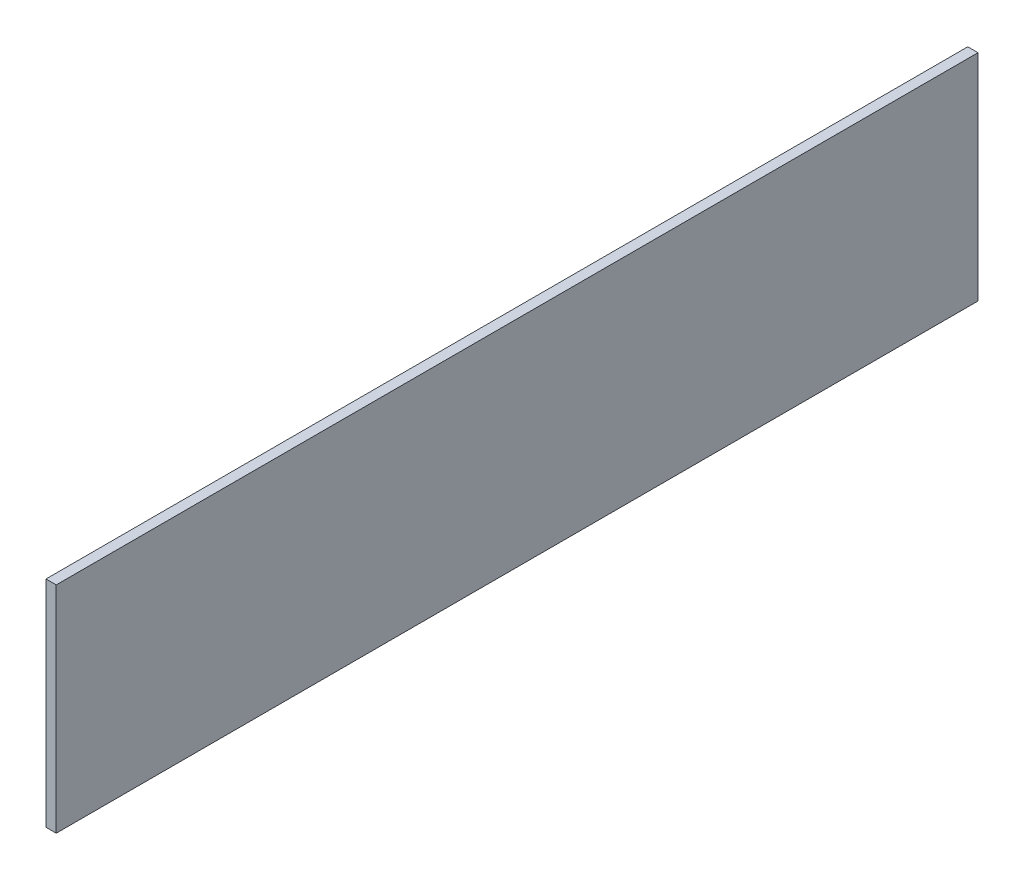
from build123d import *

# Parameters (mm, degrees)
SKETCH1_W      = 285.75
SKETCH1_H      = 66.675
EXTRUDE1_DEPTH = 3.175


with BuildPart() as part:
    # Sketch1 → Extrude1 (new body)
    with BuildSketch(Plane(origin=(0, 0, 0), x_dir=(0, 0, -1), z_dir=(1, 0, 0))):
        with Locations((142.875, 33.3375)):
            Rectangle(SKETCH1_W, SKETCH1_H)
    extrude(amount=EXTRUDE1_DEPTH)


solid = part.part
